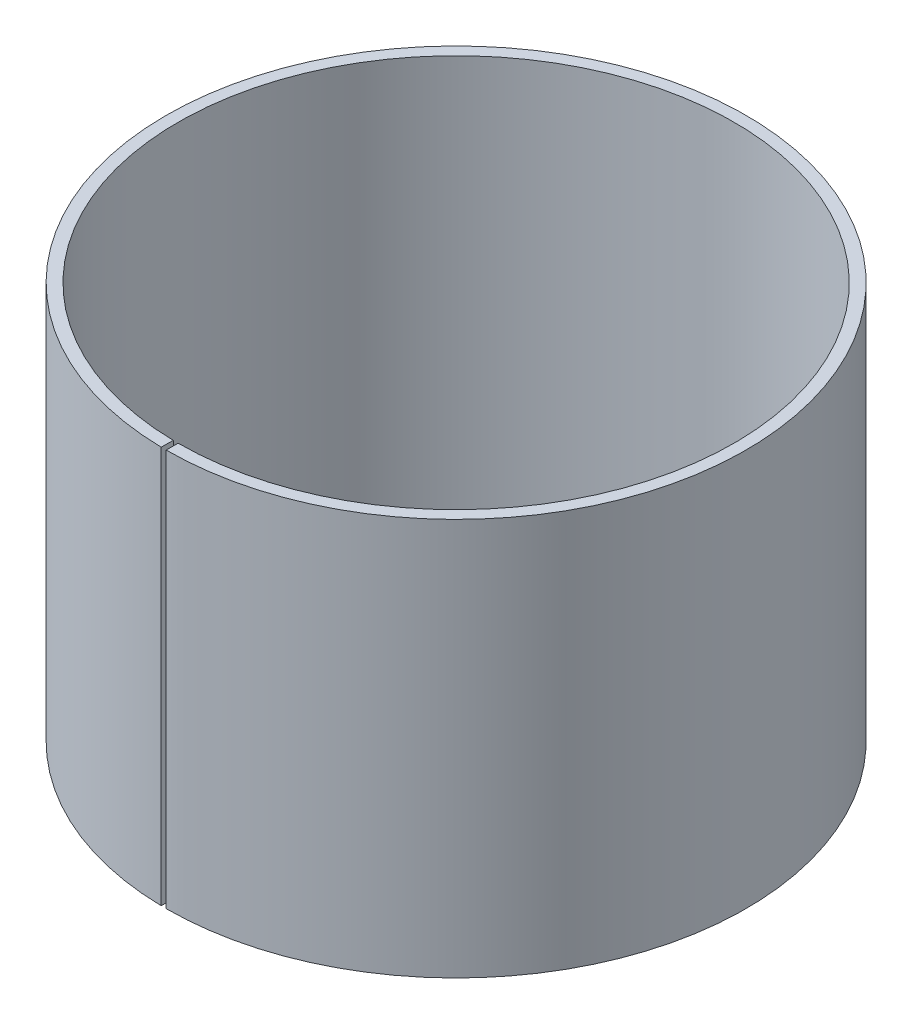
ISO-10303-21;
HEADER;
FILE_DESCRIPTION(('STEP AP214'),'2;1');
FILE_NAME('part.step','',(''),(''),'','','');
FILE_SCHEMA(('AUTOMOTIVE_DESIGN { 1 0 10303 214 1 1 1 1 }'));
ENDSEC;
DATA;
#1=APPLICATION_CONTEXT('core data for automotive mechanical design processes');
#2=APPLICATION_PROTOCOL_DEFINITION('international standard','automotive_design',2000,#1);
#3=PRODUCT_CONTEXT('',#1,'mechanical');
#4=PRODUCT('Part','Part','',(#3));
#5=PRODUCT_RELATED_PRODUCT_CATEGORY('part','',(#4));
#6=PRODUCT_DEFINITION_FORMATION('','',#4);
#7=PRODUCT_DEFINITION_CONTEXT('part definition',#1,'design');
#8=PRODUCT_DEFINITION('design','',#6,#7);
#9=PRODUCT_DEFINITION_SHAPE('','',#8);
#10=(LENGTH_UNIT() NAMED_UNIT(*) SI_UNIT(.MILLI.,.METRE.));
#11=(NAMED_UNIT(*) PLANE_ANGLE_UNIT() SI_UNIT($,.RADIAN.));
#12=(NAMED_UNIT(*) SI_UNIT($,.STERADIAN.) SOLID_ANGLE_UNIT());
#13=UNCERTAINTY_MEASURE_WITH_UNIT(LENGTH_MEASURE(1.E-05),#10,'distance_accuracy_value','');
#14=(GEOMETRIC_REPRESENTATION_CONTEXT(3) GLOBAL_UNCERTAINTY_ASSIGNED_CONTEXT((#13)) GLOBAL_UNIT_ASSIGNED_CONTEXT((#10,
#11,#12)) REPRESENTATION_CONTEXT('',''));
#15=CARTESIAN_POINT('',(0.,0.,0.));
#16=DIRECTION('',(0.,0.,1.));
#17=DIRECTION('',(1.,0.,0.));
#18=AXIS2_PLACEMENT_3D('',#15,#16,#17);
#19=CARTESIAN_POINT('',(0.,50.,0.));
#20=DIRECTION('',(0.,-1.,0.));
#21=DIRECTION('',(0.,0.,-1.));
#22=AXIS2_PLACEMENT_3D('',#19,#20,#21);
#23=CYLINDRICAL_SURFACE('',#22,36.5);
#24=CARTESIAN_POINT('',(0.,0.,0.));
#25=DIRECTION('',(0.,1.,0.));
#26=DIRECTION('',(0.,0.,1.));
#27=AXIS2_PLACEMENT_3D('',#24,#25,#26);
#28=CIRCLE('',#27,36.5);
#29=CARTESIAN_POINT('',(0.,0.,36.5));
#30=VERTEX_POINT('',#29);
#31=CARTESIAN_POINT('',(-0.63701283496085,0.,36.4944408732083));
#32=VERTEX_POINT('',#31);
#33=EDGE_CURVE('E95',#30,#32,#28,.T.);
#34=ORIENTED_EDGE('',*,*,#33,.T.);
#35=DIRECTION('',(0.,-1.,0.));
#36=VECTOR('',#35,1.);
#37=CARTESIAN_POINT('',(-0.63701283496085,50.,36.4944408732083));
#38=LINE('',#37,#36);
#39=CARTESIAN_POINT('',(-0.63701283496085,50.,36.4944408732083));
#40=VERTEX_POINT('',#39);
#41=EDGE_CURVE('E11',#40,#32,#38,.T.);
#42=ORIENTED_EDGE('',*,*,#41,.F.);
#43=CARTESIAN_POINT('',(0.,50.,0.));
#44=DIRECTION('',(0.,1.,0.));
#45=DIRECTION('',(0.,0.,1.));
#46=AXIS2_PLACEMENT_3D('',#43,#44,#45);
#47=CIRCLE('',#46,36.5);
#48=CARTESIAN_POINT('',(0.,50.,36.5));
#49=VERTEX_POINT('',#48);
#50=EDGE_CURVE('E72',#49,#40,#47,.T.);
#51=ORIENTED_EDGE('',*,*,#50,.F.);
#52=DIRECTION('',(0.,-1.,0.));
#53=VECTOR('',#52,1.);
#54=CARTESIAN_POINT('',(0.,50.,36.5));
#55=LINE('',#54,#53);
#56=EDGE_CURVE('E48',#49,#30,#55,.T.);
#57=ORIENTED_EDGE('',*,*,#56,.T.);
#58=EDGE_LOOP('',(#34,#42,#51,#57));
#59=FACE_BOUND('',#58,.T.);
#60=ADVANCED_FACE('F32',(#59),#23,.T.);
#61=CARTESIAN_POINT('',(-0.610834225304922,50.,34.9946693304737));
#62=DIRECTION('',(0.999847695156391,0.,0.017452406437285));
#63=DIRECTION('',(0.017452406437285,0.,-0.999847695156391));
#64=AXIS2_PLACEMENT_3D('',#61,#62,#63);
#65=PLANE('',#64);
#66=DIRECTION('',(-0.017452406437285,0.,0.999847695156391));
#67=VECTOR('',#66,1.);
#68=CARTESIAN_POINT('',(-0.610834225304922,0.,34.9946693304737));
#69=LINE('',#68,#67);
#70=CARTESIAN_POINT('',(-0.610834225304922,0.,34.9946693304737));
#71=VERTEX_POINT('',#70);
#72=EDGE_CURVE('E81',#71,#32,#69,.T.);
#73=ORIENTED_EDGE('',*,*,#72,.F.);
#74=DIRECTION('',(0.,-1.,0.));
#75=VECTOR('',#74,1.);
#76=CARTESIAN_POINT('',(-0.610834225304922,50.,34.9946693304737));
#77=LINE('',#76,#75);
#78=CARTESIAN_POINT('',(-0.610834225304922,50.,34.9946693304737));
#79=VERTEX_POINT('',#78);
#80=EDGE_CURVE('E40',#79,#71,#77,.T.);
#81=ORIENTED_EDGE('',*,*,#80,.F.);
#82=DIRECTION('',(-0.017452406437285,0.,0.999847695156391));
#83=VECTOR('',#82,1.);
#84=CARTESIAN_POINT('',(-0.610834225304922,50.,34.9946693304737));
#85=LINE('',#84,#83);
#86=EDGE_CURVE('E79',#79,#40,#85,.T.);
#87=ORIENTED_EDGE('',*,*,#86,.T.);
#88=ORIENTED_EDGE('',*,*,#41,.T.);
#89=EDGE_LOOP('',(#73,#81,#87,#88));
#90=FACE_BOUND('',#89,.T.);
#91=ADVANCED_FACE('F78',(#90),#65,.T.);
#92=CARTESIAN_POINT('',(0.,50.,0.));
#93=DIRECTION('',(0.,-1.,0.));
#94=DIRECTION('',(0.,0.,-1.));
#95=AXIS2_PLACEMENT_3D('',#92,#93,#94);
#96=CYLINDRICAL_SURFACE('',#95,35.);
#97=CARTESIAN_POINT('',(0.,0.,0.));
#98=DIRECTION('',(0.,1.,0.));
#99=DIRECTION('',(1.,0.,0.));
#100=AXIS2_PLACEMENT_3D('',#97,#98,#99);
#101=CIRCLE('',#100,35.);
#102=CARTESIAN_POINT('',(0.,0.,35.));
#103=VERTEX_POINT('',#102);
#104=EDGE_CURVE('E98',#103,#71,#101,.T.);
#105=ORIENTED_EDGE('',*,*,#104,.F.);
#106=DIRECTION('',(0.,-1.,0.));
#107=VECTOR('',#106,1.);
#108=CARTESIAN_POINT('',(0.,50.,35.));
#109=LINE('',#108,#107);
#110=CARTESIAN_POINT('',(0.,50.,35.));
#111=VERTEX_POINT('',#110);
#112=EDGE_CURVE('E61',#111,#103,#109,.T.);
#113=ORIENTED_EDGE('',*,*,#112,.F.);
#114=CARTESIAN_POINT('',(0.,50.,0.));
#115=DIRECTION('',(0.,1.,0.));
#116=DIRECTION('',(1.,0.,0.));
#117=AXIS2_PLACEMENT_3D('',#114,#115,#116);
#118=CIRCLE('',#117,35.);
#119=EDGE_CURVE('E87',#111,#79,#118,.T.);
#120=ORIENTED_EDGE('',*,*,#119,.T.);
#121=ORIENTED_EDGE('',*,*,#80,.T.);
#122=EDGE_LOOP('',(#105,#113,#120,#121));
#123=FACE_BOUND('',#122,.T.);
#124=ADVANCED_FACE('F89',(#123),#96,.F.);
#125=CARTESIAN_POINT('',(0.,50.,36.5));
#126=DIRECTION('',(-1.,0.,0.));
#127=DIRECTION('',(0.,0.,1.));
#128=AXIS2_PLACEMENT_3D('',#125,#126,#127);
#129=PLANE('',#128);
#130=DIRECTION('',(0.,0.,-1.));
#131=VECTOR('',#130,1.);
#132=CARTESIAN_POINT('',(0.,0.,36.5));
#133=LINE('',#132,#131);
#134=EDGE_CURVE('E100',#30,#103,#133,.T.);
#135=ORIENTED_EDGE('',*,*,#134,.F.);
#136=ORIENTED_EDGE('',*,*,#56,.F.);
#137=DIRECTION('',(0.,0.,-1.));
#138=VECTOR('',#137,1.);
#139=CARTESIAN_POINT('',(0.,50.,36.5));
#140=LINE('',#139,#138);
#141=EDGE_CURVE('E90',#49,#111,#140,.T.);
#142=ORIENTED_EDGE('',*,*,#141,.T.);
#143=ORIENTED_EDGE('',*,*,#112,.T.);
#144=EDGE_LOOP('',(#135,#136,#142,#143));
#145=FACE_BOUND('',#144,.T.);
#146=ADVANCED_FACE('F106',(#145),#129,.T.);
#147=CARTESIAN_POINT('',(0.,50.,0.));
#148=DIRECTION('',(0.,1.,0.));
#149=DIRECTION('',(1.,0.,0.));
#150=AXIS2_PLACEMENT_3D('',#147,#148,#149);
#151=PLANE('',#150);
#152=ORIENTED_EDGE('',*,*,#50,.T.);
#153=ORIENTED_EDGE('',*,*,#86,.F.);
#154=ORIENTED_EDGE('',*,*,#119,.F.);
#155=ORIENTED_EDGE('',*,*,#141,.F.);
#156=EDGE_LOOP('',(#152,#153,#154,#155));
#157=FACE_BOUND('',#156,.T.);
#158=ADVANCED_FACE('F86',(#157),#151,.T.);
#159=CARTESIAN_POINT('',(0.,0.,0.));
#160=DIRECTION('',(0.,1.,0.));
#161=DIRECTION('',(1.,0.,0.));
#162=AXIS2_PLACEMENT_3D('',#159,#160,#161);
#163=PLANE('',#162);
#164=ORIENTED_EDGE('',*,*,#33,.F.);
#165=ORIENTED_EDGE('',*,*,#134,.T.);
#166=ORIENTED_EDGE('',*,*,#104,.T.);
#167=ORIENTED_EDGE('',*,*,#72,.T.);
#168=EDGE_LOOP('',(#164,#165,#166,#167));
#169=FACE_BOUND('',#168,.T.);
#170=ADVANCED_FACE('F105',(#169),#163,.F.);
#171=CLOSED_SHELL('',(#60,#91,#124,#146,#158,#170));
#172=MANIFOLD_SOLID_BREP('B2',#171);
#173=ADVANCED_BREP_SHAPE_REPRESENTATION('',(#18,#172),#14);
#174=SHAPE_DEFINITION_REPRESENTATION(#9,#173);
ENDSEC;
END-ISO-10303-21;
